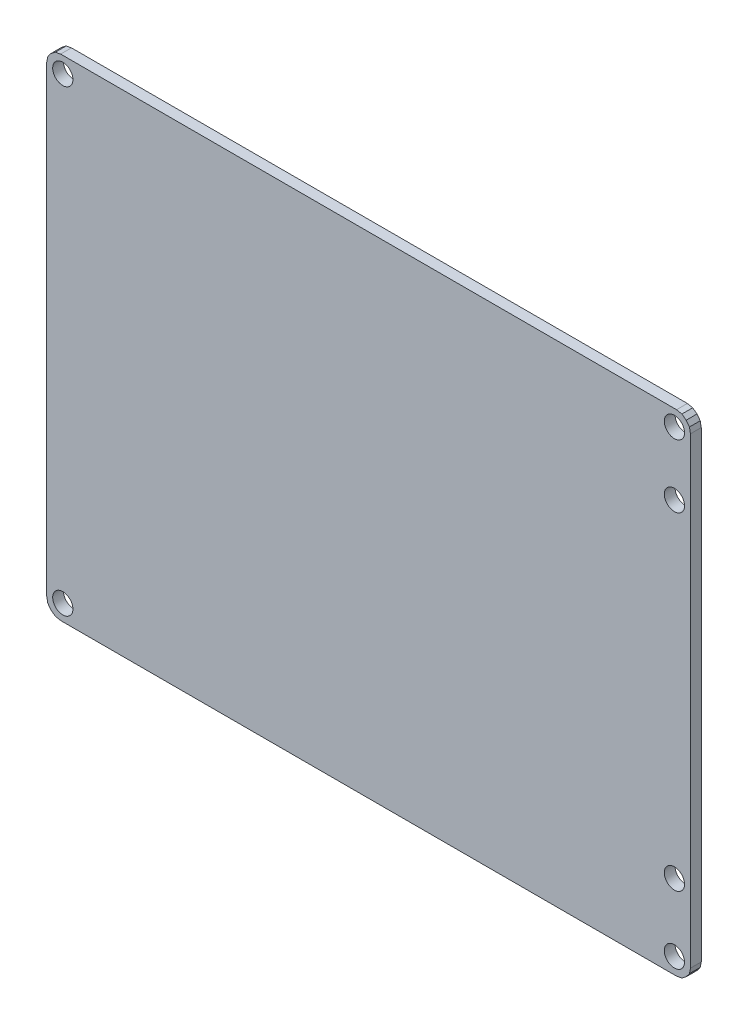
from build123d import *

# Parameters (mm, degrees)
SKETCH_1_R      = 1.5
EXTRUDE_1_DEPTH = 1.6


with BuildPart() as part:
    # Sketch 1 → Extrude 1 (new body)
    with BuildSketch(Plane.XY):
        Polygon((45.640633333, -36.353733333), (-45.640633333, -36.353733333), (-46.434366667, -36.195), (-47.069366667, -35.718733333), (-47.545633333, -35.083733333), (-47.704366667, -34.29), (-47.704366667, 34.29), (-47.545633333, 35.083733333), (-47.069366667, 35.718733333), (-46.434366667, 36.195), (-45.640633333, 36.353733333), (45.640633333, 36.353733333), (46.434366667, 36.195), (47.069366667, 35.718733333), (47.545633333, 35.083733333), (47.704366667, 34.29), (47.704366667, -34.29), (47.545633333, -35.083733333), (47.069366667, -35.718733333), (46.434366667, -36.195), align=None)
        with Locations((-45.323133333, -33.9725)):
            Circle(SKETCH_1_R, mode=Mode.SUBTRACT)
        with Locations((-45.322866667, 33.972733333)):
            Circle(SKETCH_1_R, mode=Mode.SUBTRACT)
        with Locations((45.3231, 33.9725)):
            Circle(SKETCH_1_R, mode=Mode.SUBTRACT)
        with Locations((45.323133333, 24.606266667)):
            Circle(SKETCH_1_R, mode=Mode.SUBTRACT)
        with Locations((45.3231, -33.9725)):
            Circle(SKETCH_1_R, mode=Mode.SUBTRACT)
        with Locations((45.3231, -23.971266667)):
            Circle(SKETCH_1_R, mode=Mode.SUBTRACT)
    extrude(amount=EXTRUDE_1_DEPTH)


solid = part.part
